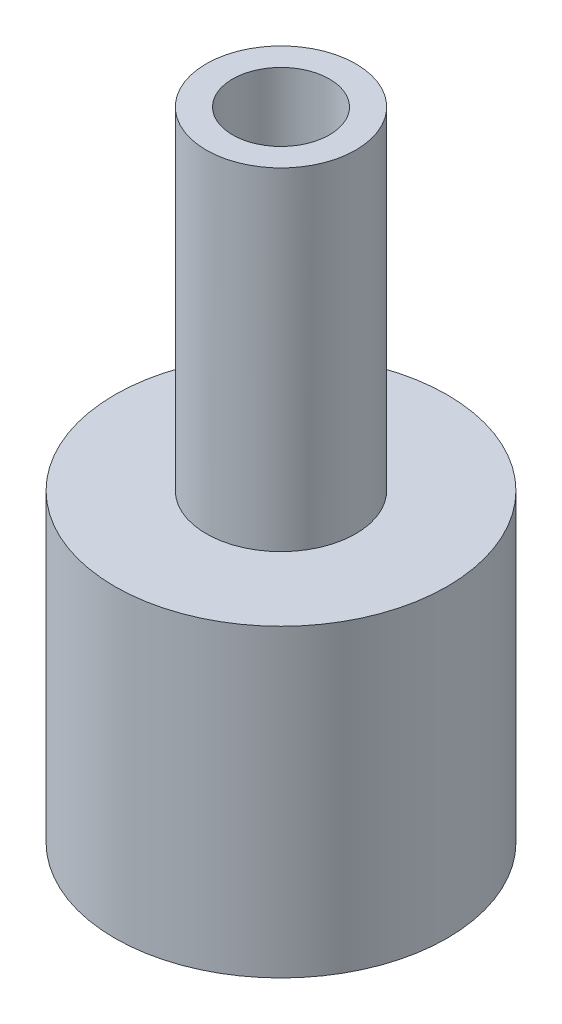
ISO-10303-21;
HEADER;
FILE_DESCRIPTION(('STEP AP214'),'2;1');
FILE_NAME('part.step','',(''),(''),'','','');
FILE_SCHEMA(('AUTOMOTIVE_DESIGN { 1 0 10303 214 1 1 1 1 }'));
ENDSEC;
DATA;
#1=APPLICATION_CONTEXT('core data for automotive mechanical design processes');
#2=APPLICATION_PROTOCOL_DEFINITION('international standard','automotive_design',2000,#1);
#3=PRODUCT_CONTEXT('',#1,'mechanical');
#4=PRODUCT('Part','Part','',(#3));
#5=PRODUCT_RELATED_PRODUCT_CATEGORY('part','',(#4));
#6=PRODUCT_DEFINITION_FORMATION('','',#4);
#7=PRODUCT_DEFINITION_CONTEXT('part definition',#1,'design');
#8=PRODUCT_DEFINITION('design','',#6,#7);
#9=PRODUCT_DEFINITION_SHAPE('','',#8);
#10=(LENGTH_UNIT() NAMED_UNIT(*) SI_UNIT(.MILLI.,.METRE.));
#11=(NAMED_UNIT(*) PLANE_ANGLE_UNIT() SI_UNIT($,.RADIAN.));
#12=(NAMED_UNIT(*) SI_UNIT($,.STERADIAN.) SOLID_ANGLE_UNIT());
#13=UNCERTAINTY_MEASURE_WITH_UNIT(LENGTH_MEASURE(1.E-05),#10,'distance_accuracy_value','');
#14=(GEOMETRIC_REPRESENTATION_CONTEXT(3) GLOBAL_UNCERTAINTY_ASSIGNED_CONTEXT((#13)) GLOBAL_UNIT_ASSIGNED_CONTEXT((#10,
#11,#12)) REPRESENTATION_CONTEXT('',''));
#15=CARTESIAN_POINT('',(0.,0.,0.));
#16=DIRECTION('',(0.,0.,1.));
#17=DIRECTION('',(1.,0.,0.));
#18=AXIS2_PLACEMENT_3D('',#15,#16,#17);
#19=CARTESIAN_POINT('',(0.,5.75,0.));
#20=DIRECTION('',(0.,-1.,0.));
#21=DIRECTION('',(0.,0.,-1.));
#22=AXIS2_PLACEMENT_3D('',#19,#20,#21);
#23=CYLINDRICAL_SURFACE('',#22,1.35);
#24=CARTESIAN_POINT('',(0.,5.75,0.));
#25=DIRECTION('',(0.,1.,0.));
#26=DIRECTION('',(0.,0.,1.));
#27=AXIS2_PLACEMENT_3D('',#24,#25,#26);
#28=CIRCLE('',#27,1.35);
#29=CARTESIAN_POINT('',(0.,5.75,1.35));
#30=VERTEX_POINT('',#29);
#31=EDGE_CURVE('E48',#30,#30,#28,.T.);
#32=ORIENTED_EDGE('',*,*,#31,.F.);
#33=EDGE_LOOP('',(#32));
#34=FACE_BOUND('',#33,.T.);
#35=CARTESIAN_POINT('',(0.,-0.25,0.));
#36=DIRECTION('',(0.,-1.,0.));
#37=DIRECTION('',(0.,0.,-1.));
#38=AXIS2_PLACEMENT_3D('',#35,#36,#37);
#39=CIRCLE('',#38,1.35);
#40=CARTESIAN_POINT('',(0.,-0.25,-1.35));
#41=VERTEX_POINT('',#40);
#42=EDGE_CURVE('E10',#41,#41,#39,.T.);
#43=ORIENTED_EDGE('',*,*,#42,.F.);
#44=EDGE_LOOP('',(#43));
#45=FACE_BOUND('',#44,.T.);
#46=ADVANCED_FACE('F41',(#34,#45),#23,.T.);
#47=CARTESIAN_POINT('',(0.,5.75,0.));
#48=DIRECTION('',(0.,1.,0.));
#49=DIRECTION('',(0.,0.,1.));
#50=AXIS2_PLACEMENT_3D('',#47,#48,#49);
#51=PLANE('',#50);
#52=CARTESIAN_POINT('',(0.,5.75,0.));
#53=DIRECTION('',(0.,-1.,0.));
#54=DIRECTION('',(0.,0.,-1.));
#55=AXIS2_PLACEMENT_3D('',#52,#53,#54);
#56=CIRCLE('',#55,0.875);
#57=CARTESIAN_POINT('',(0.,5.75,-0.875));
#58=VERTEX_POINT('',#57);
#59=EDGE_CURVE('E62',#58,#58,#56,.T.);
#60=ORIENTED_EDGE('',*,*,#59,.T.);
#61=EDGE_LOOP('',(#60));
#62=FACE_BOUND('',#61,.T.);
#63=ORIENTED_EDGE('',*,*,#31,.T.);
#64=EDGE_LOOP('',(#63));
#65=FACE_BOUND('',#64,.T.);
#66=ADVANCED_FACE('F83',(#62,#65),#51,.T.);
#67=CARTESIAN_POINT('',(0.,-0.25,0.));
#68=DIRECTION('',(0.,-1.,0.));
#69=DIRECTION('',(0.,0.,-1.));
#70=AXIS2_PLACEMENT_3D('',#67,#68,#69);
#71=CYLINDRICAL_SURFACE('',#70,3.);
#72=CARTESIAN_POINT('',(0.,-0.25,0.));
#73=DIRECTION('',(0.,-1.,0.));
#74=DIRECTION('',(0.,0.,-1.));
#75=AXIS2_PLACEMENT_3D('',#72,#73,#74);
#76=CIRCLE('',#75,3.);
#77=CARTESIAN_POINT('',(0.,-0.25,-3.));
#78=VERTEX_POINT('',#77);
#79=EDGE_CURVE('E53',#78,#78,#76,.T.);
#80=ORIENTED_EDGE('',*,*,#79,.T.);
#81=EDGE_LOOP('',(#80));
#82=FACE_BOUND('',#81,.T.);
#83=CARTESIAN_POINT('',(0.,-5.75,0.));
#84=DIRECTION('',(0.,-1.,0.));
#85=DIRECTION('',(0.,0.,-1.));
#86=AXIS2_PLACEMENT_3D('',#83,#84,#85);
#87=CIRCLE('',#86,3.);
#88=CARTESIAN_POINT('',(0.,-5.75,-3.));
#89=VERTEX_POINT('',#88);
#90=EDGE_CURVE('E56',#89,#89,#87,.T.);
#91=ORIENTED_EDGE('',*,*,#90,.F.);
#92=EDGE_LOOP('',(#91));
#93=FACE_BOUND('',#92,.T.);
#94=ADVANCED_FACE('F88',(#82,#93),#71,.T.);
#95=CARTESIAN_POINT('',(0.,-0.25,0.));
#96=DIRECTION('',(0.,-1.,0.));
#97=DIRECTION('',(0.,0.,-1.));
#98=AXIS2_PLACEMENT_3D('',#95,#96,#97);
#99=PLANE('',#98);
#100=ORIENTED_EDGE('',*,*,#42,.T.);
#101=EDGE_LOOP('',(#100));
#102=FACE_BOUND('',#101,.T.);
#103=ORIENTED_EDGE('',*,*,#79,.F.);
#104=EDGE_LOOP('',(#103));
#105=FACE_BOUND('',#104,.T.);
#106=ADVANCED_FACE('F80',(#102,#105),#99,.F.);
#107=CARTESIAN_POINT('',(0.,-5.75,0.));
#108=DIRECTION('',(0.,1.,0.));
#109=DIRECTION('',(0.,0.,1.));
#110=AXIS2_PLACEMENT_3D('',#107,#108,#109);
#111=PLANE('',#110);
#112=CARTESIAN_POINT('',(0.,-5.75,0.));
#113=DIRECTION('',(0.,1.,0.));
#114=DIRECTION('',(0.,0.,1.));
#115=AXIS2_PLACEMENT_3D('',#112,#113,#114);
#116=CIRCLE('',#115,0.875);
#117=CARTESIAN_POINT('',(0.,-5.75,0.875));
#118=VERTEX_POINT('',#117);
#119=EDGE_CURVE('E44',#118,#118,#116,.T.);
#120=ORIENTED_EDGE('',*,*,#119,.T.);
#121=EDGE_LOOP('',(#120));
#122=FACE_BOUND('',#121,.T.);
#123=ORIENTED_EDGE('',*,*,#90,.T.);
#124=EDGE_LOOP('',(#123));
#125=FACE_BOUND('',#124,.T.);
#126=ADVANCED_FACE('F70',(#122,#125),#111,.F.);
#127=CARTESIAN_POINT('',(0.,5.75,0.));
#128=DIRECTION('',(0.,-1.,0.));
#129=DIRECTION('',(0.,0.,-1.));
#130=AXIS2_PLACEMENT_3D('',#127,#128,#129);
#131=CYLINDRICAL_SURFACE('',#130,0.875);
#132=ORIENTED_EDGE('',*,*,#59,.F.);
#133=EDGE_LOOP('',(#132));
#134=FACE_BOUND('',#133,.T.);
#135=ORIENTED_EDGE('',*,*,#119,.F.);
#136=EDGE_LOOP('',(#135));
#137=FACE_BOUND('',#136,.T.);
#138=ADVANCED_FACE('F73',(#134,#137),#131,.F.);
#139=CLOSED_SHELL('',(#46,#66,#94,#106,#126,#138));
#140=MANIFOLD_SOLID_BREP('B2',#139);
#141=ADVANCED_BREP_SHAPE_REPRESENTATION('',(#18,#140),#14);
#142=SHAPE_DEFINITION_REPRESENTATION(#9,#141);
ENDSEC;
END-ISO-10303-21;
